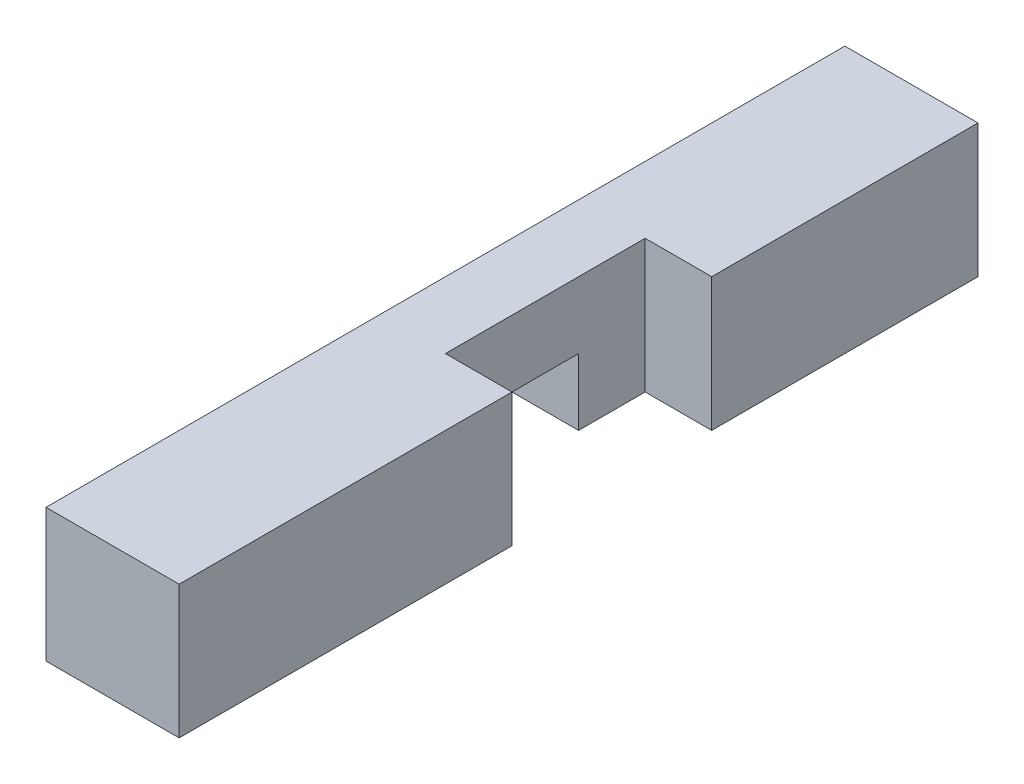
ISO-10303-21;
HEADER;
FILE_DESCRIPTION(('STEP AP214'),'2;1');
FILE_NAME('part.step','',(''),(''),'','','');
FILE_SCHEMA(('AUTOMOTIVE_DESIGN { 1 0 10303 214 1 1 1 1 }'));
ENDSEC;
DATA;
#1=APPLICATION_CONTEXT('core data for automotive mechanical design processes');
#2=APPLICATION_PROTOCOL_DEFINITION('international standard','automotive_design',2000,#1);
#3=PRODUCT_CONTEXT('',#1,'mechanical');
#4=PRODUCT('Part','Part','',(#3));
#5=PRODUCT_RELATED_PRODUCT_CATEGORY('part','',(#4));
#6=PRODUCT_DEFINITION_FORMATION('','',#4);
#7=PRODUCT_DEFINITION_CONTEXT('part definition',#1,'design');
#8=PRODUCT_DEFINITION('design','',#6,#7);
#9=PRODUCT_DEFINITION_SHAPE('','',#8);
#10=(LENGTH_UNIT() NAMED_UNIT(*) SI_UNIT(.MILLI.,.METRE.));
#11=(NAMED_UNIT(*) PLANE_ANGLE_UNIT() SI_UNIT($,.RADIAN.));
#12=(NAMED_UNIT(*) SI_UNIT($,.STERADIAN.) SOLID_ANGLE_UNIT());
#13=UNCERTAINTY_MEASURE_WITH_UNIT(LENGTH_MEASURE(1.E-05),#10,'distance_accuracy_value','');
#14=(GEOMETRIC_REPRESENTATION_CONTEXT(3) GLOBAL_UNCERTAINTY_ASSIGNED_CONTEXT((#13)) GLOBAL_UNIT_ASSIGNED_CONTEXT((#10,
#11,#12)) REPRESENTATION_CONTEXT('',''));
#15=CARTESIAN_POINT('',(0.,0.,0.));
#16=DIRECTION('',(0.,0.,1.));
#17=DIRECTION('',(1.,0.,0.));
#18=AXIS2_PLACEMENT_3D('',#15,#16,#17);
#19=CARTESIAN_POINT('',(0.,0.,120.));
#20=DIRECTION('',(0.,1.,0.));
#21=DIRECTION('',(0.,0.,1.));
#22=AXIS2_PLACEMENT_3D('',#19,#20,#21);
#23=PLANE('',#22);
#24=DIRECTION('',(0.,0.,-1.));
#25=VECTOR('',#24,1.);
#26=CARTESIAN_POINT('',(0.,0.,120.));
#27=LINE('',#26,#25);
#28=CARTESIAN_POINT('',(0.,0.,120.));
#29=VERTEX_POINT('',#28);
#30=CARTESIAN_POINT('',(0.,0.,70.));
#31=VERTEX_POINT('',#30);
#32=EDGE_CURVE('E11',#29,#31,#27,.T.);
#33=ORIENTED_EDGE('',*,*,#32,.T.);
#34=DIRECTION('',(1.,0.,0.));
#35=VECTOR('',#34,1.);
#36=CARTESIAN_POINT('',(20.,0.,70.));
#37=LINE('',#36,#35);
#38=CARTESIAN_POINT('',(20.,0.,70.));
#39=VERTEX_POINT('',#38);
#40=EDGE_CURVE('E116',#31,#39,#37,.T.);
#41=ORIENTED_EDGE('',*,*,#40,.T.);
#42=DIRECTION('',(0.,0.,-1.));
#43=VECTOR('',#42,1.);
#44=CARTESIAN_POINT('',(20.,0.,120.));
#45=LINE('',#44,#43);
#46=CARTESIAN_POINT('',(20.,0.,120.));
#47=VERTEX_POINT('',#46);
#48=EDGE_CURVE('E139',#47,#39,#45,.T.);
#49=ORIENTED_EDGE('',*,*,#48,.F.);
#50=DIRECTION('',(1.,0.,0.));
#51=VECTOR('',#50,1.);
#52=CARTESIAN_POINT('',(0.,0.,120.));
#53=LINE('',#52,#51);
#54=EDGE_CURVE('E137',#29,#47,#53,.T.);
#55=ORIENTED_EDGE('',*,*,#54,.F.);
#56=EDGE_LOOP('',(#33,#41,#49,#55));
#57=FACE_BOUND('',#56,.T.);
#58=ADVANCED_FACE('F31',(#57),#23,.F.);
#59=CARTESIAN_POINT('',(20.,0.,120.));
#60=DIRECTION('',(-1.,0.,0.));
#61=DIRECTION('',(0.,0.,1.));
#62=AXIS2_PLACEMENT_3D('',#59,#60,#61);
#63=PLANE('',#62);
#64=ORIENTED_EDGE('',*,*,#48,.T.);
#65=DIRECTION('',(0.,1.,0.));
#66=VECTOR('',#65,1.);
#67=CARTESIAN_POINT('',(20.,0.,70.));
#68=LINE('',#67,#66);
#69=CARTESIAN_POINT('',(20.,20.,70.));
#70=VERTEX_POINT('',#69);
#71=EDGE_CURVE('E122',#39,#70,#68,.T.);
#72=ORIENTED_EDGE('',*,*,#71,.T.);
#73=DIRECTION('',(0.,0.,-1.));
#74=VECTOR('',#73,1.);
#75=CARTESIAN_POINT('',(20.,20.,120.));
#76=LINE('',#75,#74);
#77=CARTESIAN_POINT('',(20.,20.,120.));
#78=VERTEX_POINT('',#77);
#79=EDGE_CURVE('E170',#78,#70,#76,.T.);
#80=ORIENTED_EDGE('',*,*,#79,.F.);
#81=DIRECTION('',(0.,1.,0.));
#82=VECTOR('',#81,1.);
#83=CARTESIAN_POINT('',(20.,0.,120.));
#84=LINE('',#83,#82);
#85=EDGE_CURVE('E142',#47,#78,#84,.T.);
#86=ORIENTED_EDGE('',*,*,#85,.F.);
#87=EDGE_LOOP('',(#64,#72,#80,#86));
#88=FACE_BOUND('',#87,.T.);
#89=ADVANCED_FACE('F224',(#88),#63,.F.);
#90=CARTESIAN_POINT('',(0.,0.,120.));
#91=DIRECTION('',(1.,0.,0.));
#92=DIRECTION('',(0.,0.,-1.));
#93=AXIS2_PLACEMENT_3D('',#90,#91,#92);
#94=PLANE('',#93);
#95=DIRECTION('',(0.,0.,1.));
#96=VECTOR('',#95,1.);
#97=CARTESIAN_POINT('',(0.,10.,70.));
#98=LINE('',#97,#96);
#99=CARTESIAN_POINT('',(0.,10.,50.));
#100=VERTEX_POINT('',#99);
#101=CARTESIAN_POINT('',(0.,10.,70.));
#102=VERTEX_POINT('',#101);
#103=EDGE_CURVE('E133',#100,#102,#98,.T.);
#104=ORIENTED_EDGE('',*,*,#103,.T.);
#105=DIRECTION('',(0.,-1.,0.));
#106=VECTOR('',#105,1.);
#107=CARTESIAN_POINT('',(0.,0.,70.));
#108=LINE('',#107,#106);
#109=EDGE_CURVE('E119',#102,#31,#108,.T.);
#110=ORIENTED_EDGE('',*,*,#109,.T.);
#111=ORIENTED_EDGE('',*,*,#32,.F.);
#112=DIRECTION('',(0.,-1.,0.));
#113=VECTOR('',#112,1.);
#114=CARTESIAN_POINT('',(0.,0.,120.));
#115=LINE('',#114,#113);
#116=CARTESIAN_POINT('',(0.,20.,120.));
#117=VERTEX_POINT('',#116);
#118=EDGE_CURVE('E143',#117,#29,#115,.T.);
#119=ORIENTED_EDGE('',*,*,#118,.F.);
#120=DIRECTION('',(0.,0.,-1.));
#121=VECTOR('',#120,1.);
#122=CARTESIAN_POINT('',(0.,20.,120.));
#123=LINE('',#122,#121);
#124=CARTESIAN_POINT('',(0.,20.,0.));
#125=VERTEX_POINT('',#124);
#126=EDGE_CURVE('E159',#117,#125,#123,.T.);
#127=ORIENTED_EDGE('',*,*,#126,.T.);
#128=DIRECTION('',(0.,-1.,0.));
#129=VECTOR('',#128,1.);
#130=CARTESIAN_POINT('',(0.,0.,0.));
#131=LINE('',#130,#129);
#132=CARTESIAN_POINT('',(0.,0.,0.));
#133=VERTEX_POINT('',#132);
#134=EDGE_CURVE('E160',#125,#133,#131,.T.);
#135=ORIENTED_EDGE('',*,*,#134,.T.);
#136=CARTESIAN_POINT('',(0.,0.,50.));
#137=VERTEX_POINT('',#136);
#138=EDGE_CURVE('E39',#137,#133,#27,.T.);
#139=ORIENTED_EDGE('',*,*,#138,.F.);
#140=DIRECTION('',(0.,1.,0.));
#141=VECTOR('',#140,1.);
#142=CARTESIAN_POINT('',(0.,0.,50.));
#143=LINE('',#142,#141);
#144=EDGE_CURVE('E134',#137,#100,#143,.T.);
#145=ORIENTED_EDGE('',*,*,#144,.T.);
#146=EDGE_LOOP('',(#104,#110,#111,#119,#127,#135,#139,#145));
#147=FACE_BOUND('',#146,.T.);
#148=ADVANCED_FACE('F33',(#147),#94,.F.);
#149=DIRECTION('',(0.,0.,1.));
#150=VECTOR('',#149,1.);
#151=CARTESIAN_POINT('',(10.,0.,70.));
#152=LINE('',#151,#150);
#153=CARTESIAN_POINT('',(10.,0.,40.));
#154=VERTEX_POINT('',#153);
#155=CARTESIAN_POINT('',(10.,0.,50.));
#156=VERTEX_POINT('',#155);
#157=EDGE_CURVE('E126',#154,#156,#152,.T.);
#158=ORIENTED_EDGE('',*,*,#157,.T.);
#159=DIRECTION('',(1.,0.,0.));
#160=VECTOR('',#159,1.);
#161=CARTESIAN_POINT('',(0.,0.,50.));
#162=LINE('',#161,#160);
#163=EDGE_CURVE('E46',#137,#156,#162,.T.);
#164=ORIENTED_EDGE('',*,*,#163,.F.);
#165=ORIENTED_EDGE('',*,*,#138,.T.);
#166=DIRECTION('',(1.,0.,0.));
#167=VECTOR('',#166,1.);
#168=CARTESIAN_POINT('',(0.,0.,0.));
#169=LINE('',#168,#167);
#170=CARTESIAN_POINT('',(20.,0.,0.));
#171=VERTEX_POINT('',#170);
#172=EDGE_CURVE('E163',#133,#171,#169,.T.);
#173=ORIENTED_EDGE('',*,*,#172,.T.);
#174=CARTESIAN_POINT('',(20.,0.,40.));
#175=VERTEX_POINT('',#174);
#176=EDGE_CURVE('E172',#175,#171,#45,.T.);
#177=ORIENTED_EDGE('',*,*,#176,.F.);
#178=DIRECTION('',(-1.,0.,0.));
#179=VECTOR('',#178,1.);
#180=CARTESIAN_POINT('',(20.,0.,40.));
#181=LINE('',#180,#179);
#182=EDGE_CURVE('E204',#175,#154,#181,.T.);
#183=ORIENTED_EDGE('',*,*,#182,.T.);
#184=EDGE_LOOP('',(#158,#164,#165,#173,#177,#183));
#185=FACE_BOUND('',#184,.T.);
#186=ADVANCED_FACE('F184',(#185),#23,.F.);
#187=CARTESIAN_POINT('',(20.,20.,40.));
#188=VERTEX_POINT('',#187);
#189=CARTESIAN_POINT('',(20.,20.,0.));
#190=VERTEX_POINT('',#189);
#191=EDGE_CURVE('E169',#188,#190,#76,.T.);
#192=ORIENTED_EDGE('',*,*,#191,.F.);
#193=DIRECTION('',(0.,1.,0.));
#194=VECTOR('',#193,1.);
#195=CARTESIAN_POINT('',(20.,0.,40.));
#196=LINE('',#195,#194);
#197=EDGE_CURVE('E54',#175,#188,#196,.T.);
#198=ORIENTED_EDGE('',*,*,#197,.F.);
#199=ORIENTED_EDGE('',*,*,#176,.T.);
#200=DIRECTION('',(0.,1.,0.));
#201=VECTOR('',#200,1.);
#202=CARTESIAN_POINT('',(20.,0.,0.));
#203=LINE('',#202,#201);
#204=EDGE_CURVE('E152',#171,#190,#203,.T.);
#205=ORIENTED_EDGE('',*,*,#204,.T.);
#206=EDGE_LOOP('',(#192,#198,#199,#205));
#207=FACE_BOUND('',#206,.T.);
#208=ADVANCED_FACE('F177',(#207),#63,.F.);
#209=CARTESIAN_POINT('',(0.,20.,120.));
#210=DIRECTION('',(0.,-1.,0.));
#211=DIRECTION('',(0.,0.,-1.));
#212=AXIS2_PLACEMENT_3D('',#209,#210,#211);
#213=PLANE('',#212);
#214=ORIENTED_EDGE('',*,*,#79,.T.);
#215=DIRECTION('',(1.,0.,0.));
#216=VECTOR('',#215,1.);
#217=CARTESIAN_POINT('',(20.,20.,70.));
#218=LINE('',#217,#216);
#219=CARTESIAN_POINT('',(10.,20.,70.));
#220=VERTEX_POINT('',#219);
#221=EDGE_CURVE('E206',#220,#70,#218,.T.);
#222=ORIENTED_EDGE('',*,*,#221,.F.);
#223=DIRECTION('',(0.,0.,1.));
#224=VECTOR('',#223,1.);
#225=CARTESIAN_POINT('',(10.,20.,70.));
#226=LINE('',#225,#224);
#227=CARTESIAN_POINT('',(10.,20.,40.));
#228=VERTEX_POINT('',#227);
#229=EDGE_CURVE('E209',#228,#220,#226,.T.);
#230=ORIENTED_EDGE('',*,*,#229,.F.);
#231=DIRECTION('',(-1.,0.,0.));
#232=VECTOR('',#231,1.);
#233=CARTESIAN_POINT('',(20.,20.,40.));
#234=LINE('',#233,#232);
#235=EDGE_CURVE('E200',#188,#228,#234,.T.);
#236=ORIENTED_EDGE('',*,*,#235,.F.);
#237=ORIENTED_EDGE('',*,*,#191,.T.);
#238=DIRECTION('',(-1.,0.,0.));
#239=VECTOR('',#238,1.);
#240=CARTESIAN_POINT('',(0.,20.,0.));
#241=LINE('',#240,#239);
#242=EDGE_CURVE('E150',#190,#125,#241,.T.);
#243=ORIENTED_EDGE('',*,*,#242,.T.);
#244=ORIENTED_EDGE('',*,*,#126,.F.);
#245=DIRECTION('',(-1.,0.,0.));
#246=VECTOR('',#245,1.);
#247=CARTESIAN_POINT('',(0.,20.,120.));
#248=LINE('',#247,#246);
#249=EDGE_CURVE('E147',#78,#117,#248,.T.);
#250=ORIENTED_EDGE('',*,*,#249,.F.);
#251=EDGE_LOOP('',(#214,#222,#230,#236,#237,#243,#244,#250));
#252=FACE_BOUND('',#251,.T.);
#253=ADVANCED_FACE('F190',(#252),#213,.F.);
#254=CARTESIAN_POINT('',(0.,20.,120.));
#255=DIRECTION('',(0.,0.,-1.));
#256=DIRECTION('',(-1.,0.,0.));
#257=AXIS2_PLACEMENT_3D('',#254,#255,#256);
#258=PLANE('',#257);
#259=ORIENTED_EDGE('',*,*,#118,.T.);
#260=ORIENTED_EDGE('',*,*,#54,.T.);
#261=ORIENTED_EDGE('',*,*,#85,.T.);
#262=ORIENTED_EDGE('',*,*,#249,.T.);
#263=EDGE_LOOP('',(#259,#260,#261,#262));
#264=FACE_BOUND('',#263,.T.);
#265=ADVANCED_FACE('F145',(#264),#258,.F.);
#266=CARTESIAN_POINT('',(0.,20.,0.));
#267=DIRECTION('',(0.,0.,-1.));
#268=DIRECTION('',(-1.,0.,0.));
#269=AXIS2_PLACEMENT_3D('',#266,#267,#268);
#270=PLANE('',#269);
#271=ORIENTED_EDGE('',*,*,#134,.F.);
#272=ORIENTED_EDGE('',*,*,#242,.F.);
#273=ORIENTED_EDGE('',*,*,#204,.F.);
#274=ORIENTED_EDGE('',*,*,#172,.F.);
#275=EDGE_LOOP('',(#271,#272,#273,#274));
#276=FACE_BOUND('',#275,.T.);
#277=ADVANCED_FACE('F188',(#276),#270,.T.);
#278=CARTESIAN_POINT('',(20.,0.,70.));
#279=DIRECTION('',(0.,0.,1.));
#280=DIRECTION('',(1.,0.,0.));
#281=AXIS2_PLACEMENT_3D('',#278,#279,#280);
#282=PLANE('',#281);
#283=ORIENTED_EDGE('',*,*,#221,.T.);
#284=ORIENTED_EDGE('',*,*,#71,.F.);
#285=ORIENTED_EDGE('',*,*,#40,.F.);
#286=ORIENTED_EDGE('',*,*,#109,.F.);
#287=DIRECTION('',(1.,0.,0.));
#288=VECTOR('',#287,1.);
#289=CARTESIAN_POINT('',(0.,10.,70.));
#290=LINE('',#289,#288);
#291=CARTESIAN_POINT('',(10.,10.,70.));
#292=VERTEX_POINT('',#291);
#293=EDGE_CURVE('E198',#102,#292,#290,.T.);
#294=ORIENTED_EDGE('',*,*,#293,.T.);
#295=DIRECTION('',(0.,1.,0.));
#296=VECTOR('',#295,1.);
#297=CARTESIAN_POINT('',(10.,0.,70.));
#298=LINE('',#297,#296);
#299=EDGE_CURVE('E214',#292,#220,#298,.T.);
#300=ORIENTED_EDGE('',*,*,#299,.T.);
#301=EDGE_LOOP('',(#283,#284,#285,#286,#294,#300));
#302=FACE_BOUND('',#301,.T.);
#303=ADVANCED_FACE('F118',(#302),#282,.F.);
#304=CARTESIAN_POINT('',(10.,0.,70.));
#305=DIRECTION('',(-1.,0.,0.));
#306=DIRECTION('',(0.,0.,1.));
#307=AXIS2_PLACEMENT_3D('',#304,#305,#306);
#308=PLANE('',#307);
#309=ORIENTED_EDGE('',*,*,#299,.F.);
#310=DIRECTION('',(0.,0.,1.));
#311=VECTOR('',#310,1.);
#312=CARTESIAN_POINT('',(10.,10.,70.));
#313=LINE('',#312,#311);
#314=CARTESIAN_POINT('',(10.,10.,50.));
#315=VERTEX_POINT('',#314);
#316=EDGE_CURVE('E135',#315,#292,#313,.T.);
#317=ORIENTED_EDGE('',*,*,#316,.F.);
#318=DIRECTION('',(0.,1.,0.));
#319=VECTOR('',#318,1.);
#320=CARTESIAN_POINT('',(10.,0.,50.));
#321=LINE('',#320,#319);
#322=EDGE_CURVE('E194',#156,#315,#321,.T.);
#323=ORIENTED_EDGE('',*,*,#322,.F.);
#324=ORIENTED_EDGE('',*,*,#157,.F.);
#325=DIRECTION('',(0.,1.,0.));
#326=VECTOR('',#325,1.);
#327=CARTESIAN_POINT('',(10.,0.,40.));
#328=LINE('',#327,#326);
#329=EDGE_CURVE('E215',#154,#228,#328,.T.);
#330=ORIENTED_EDGE('',*,*,#329,.T.);
#331=ORIENTED_EDGE('',*,*,#229,.T.);
#332=EDGE_LOOP('',(#309,#317,#323,#324,#330,#331));
#333=FACE_BOUND('',#332,.T.);
#334=ADVANCED_FACE('F219',(#333),#308,.F.);
#335=CARTESIAN_POINT('',(20.,0.,40.));
#336=DIRECTION('',(0.,0.,-1.));
#337=DIRECTION('',(-1.,0.,0.));
#338=AXIS2_PLACEMENT_3D('',#335,#336,#337);
#339=PLANE('',#338);
#340=ORIENTED_EDGE('',*,*,#235,.T.);
#341=ORIENTED_EDGE('',*,*,#329,.F.);
#342=ORIENTED_EDGE('',*,*,#182,.F.);
#343=ORIENTED_EDGE('',*,*,#197,.T.);
#344=EDGE_LOOP('',(#340,#341,#342,#343));
#345=FACE_BOUND('',#344,.T.);
#346=ADVANCED_FACE('F222',(#345),#339,.F.);
#347=CARTESIAN_POINT('',(0.,10.,70.));
#348=DIRECTION('',(0.,1.,0.));
#349=DIRECTION('',(0.,0.,1.));
#350=AXIS2_PLACEMENT_3D('',#347,#348,#349);
#351=PLANE('',#350);
#352=ORIENTED_EDGE('',*,*,#316,.T.);
#353=ORIENTED_EDGE('',*,*,#293,.F.);
#354=ORIENTED_EDGE('',*,*,#103,.F.);
#355=DIRECTION('',(1.,0.,0.));
#356=VECTOR('',#355,1.);
#357=CARTESIAN_POINT('',(0.,10.,50.));
#358=LINE('',#357,#356);
#359=EDGE_CURVE('E201',#100,#315,#358,.T.);
#360=ORIENTED_EDGE('',*,*,#359,.T.);
#361=EDGE_LOOP('',(#352,#353,#354,#360));
#362=FACE_BOUND('',#361,.T.);
#363=ADVANCED_FACE('F260',(#362),#351,.F.);
#364=CARTESIAN_POINT('',(0.,0.,50.));
#365=DIRECTION('',(0.,0.,-1.));
#366=DIRECTION('',(-1.,0.,0.));
#367=AXIS2_PLACEMENT_3D('',#364,#365,#366);
#368=PLANE('',#367);
#369=ORIENTED_EDGE('',*,*,#322,.T.);
#370=ORIENTED_EDGE('',*,*,#359,.F.);
#371=ORIENTED_EDGE('',*,*,#144,.F.);
#372=ORIENTED_EDGE('',*,*,#163,.T.);
#373=EDGE_LOOP('',(#369,#370,#371,#372));
#374=FACE_BOUND('',#373,.T.);
#375=ADVANCED_FACE('F302',(#374),#368,.F.);
#376=CLOSED_SHELL('',(#58,#89,#148,#186,#208,#253,#265,#277,#303,#334,#346,#363,#375));
#377=MANIFOLD_SOLID_BREP('B2',#376);
#378=ADVANCED_BREP_SHAPE_REPRESENTATION('',(#18,#377),#14);
#379=SHAPE_DEFINITION_REPRESENTATION(#9,#378);
ENDSEC;
END-ISO-10303-21;
